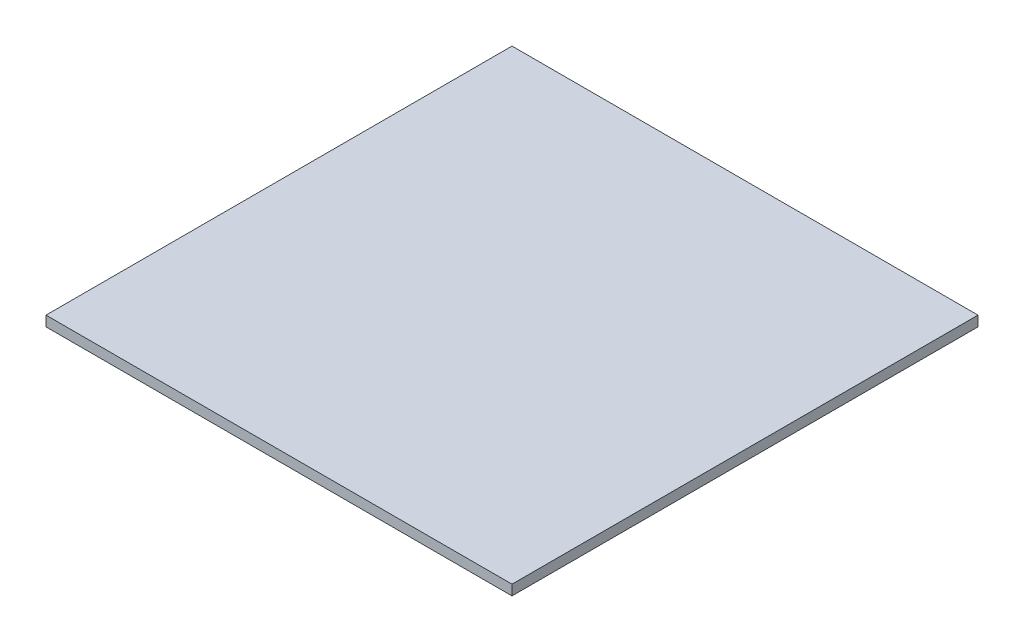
from build123d import *

# Parameters (mm, degrees)
SKETCH1_W           = 228.6
SKETCH1_H           = 228.6
BOSS_EXTRUDE1_DEPTH = 5


with BuildPart() as part:
    # Sketch1 → Boss-Extrude1 (new body)
    with BuildSketch(Plane(origin=(0, 0, 0), x_dir=(1, 0, 0), z_dir=(0, 1, 0))):
        Rectangle(SKETCH1_W, SKETCH1_H)
    extrude(amount=BOSS_EXTRUDE1_DEPTH)


solid = part.part
